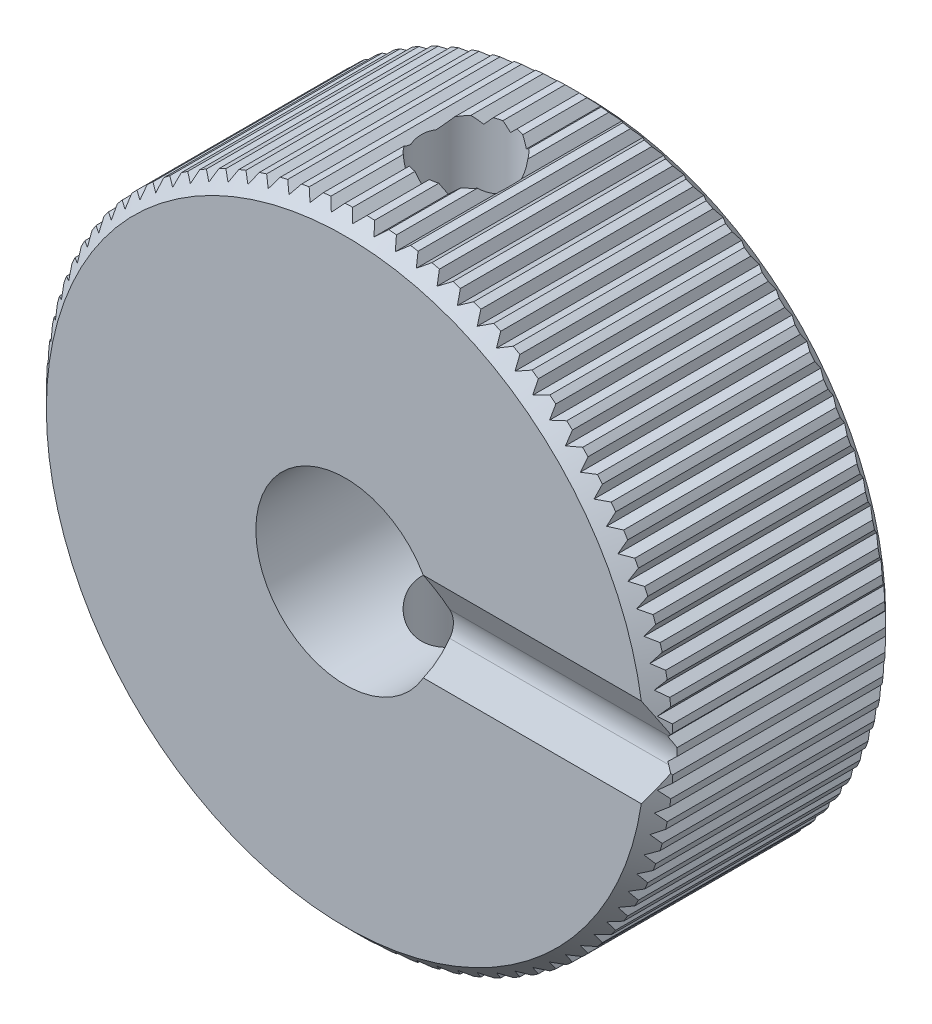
from build123d import *

# Parameters (mm, degrees)
SKETCH1_R               = 5.5499
SKETCH1_R_2             = 1.5875
BOSS_EXTRUDE1_DEPTH     = 2.1336
CHAMFER1_SIZE           = 0.254
CUT_EXTRUDE3_DEPTH      = 9.133574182
CUT_EXTRUDE1_DEPTH      = 9.133574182
CUT_EXTRUDE1_DEPTH_BACK = 9.133574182
SKETCH2_R               = 0.7874
CUT_EXTRUDE2_REACH      = 10.134
CUT_EXTRUDE2_END_RADIUS = 5.5499
CIRPATTERN1_COUNT       = 90


with BuildPart() as part:
    # Sketch1 → Boss-Extrude1 (new, symmetric)
    with BuildSketch(Plane.XY):
        Circle(SKETCH1_R)
        Circle(SKETCH1_R_2, mode=Mode.SUBTRACT)
    extrude(amount=BOSS_EXTRUDE1_DEPTH, both=True)

    # Chamfer1
    chamfer1_edges = [part.edges().sort_by_distance(p)[0] for p in [
        (-5.5499, 0, -2.1336),
        (-5.5499, 0, 2.1336),
    ]]
    chamfer(chamfer1_edges, length=CHAMFER1_SIZE)

    # Sketch4 → Cut-Extrude3 (cut, symmetric)
    with BuildSketch(Plane.XY):
        Polygon((0.127, 5.5499), (-0.127, 5.5499), (0, 5.4229), align=None)
    cut_extrude3 = extrude(amount=CUT_EXTRUDE3_DEPTH, both=True, mode=Mode.SUBTRACT)

    # Sketch2 → Cut-Extrude1 (cut, two sides: drawn at the far end of the back side and taken through both)
    with BuildSketch(Plane(origin=(0, 0, 0), x_dir=(1, 0, 0), z_dir=(0, 1, 0)).offset(-CUT_EXTRUDE1_DEPTH_BACK)):
        with Locations(Location((0, 0, 0), (0, 0, 270))):
            Circle(SKETCH2_R)
    extrude(amount=CUT_EXTRUDE1_DEPTH + CUT_EXTRUDE1_DEPTH_BACK, mode=Mode.SUBTRACT)

    # Cut-Extrude2: up to this cylinder (the profile starts inside it)
    cut_extrude2_end = Plane(origin=(0, 0, 2.013162), z_dir=(0, 0, -1)) * Cylinder(CUT_EXTRUDE2_END_RADIUS, 32.3678, mode=Mode.PRIVATE)
    # Sketch3 → Cut-Extrude2 (cut, up to the surface)
    with BuildSketch(Plane(origin=(0, 0, 0), x_dir=(0, 0, -1), z_dir=(1, 0, 0)), mode=Mode.PRIVATE) as cut_extrude2_sk1:
        with BuildLine():
            Line((-2.1336, 0.7874), (-1.860335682, 0.220621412))
            ThreePointArc((-1.860335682, 0.220621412), (-1.809927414, 0), (-1.860335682, -0.220621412))
            Line((-1.860335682, -0.220621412), (-2.1336, -0.7874))
            Line((-2.1336, -0.7874), (-2.1336, 0.7874))
        make_face()
    cut_extrude2_tool1 = extrude(cut_extrude2_sk1.sketch, amount=CUT_EXTRUDE2_REACH, mode=Mode.PRIVATE) & cut_extrude2_end
    add(cut_extrude2_tool1.solids().sort_by_distance((0, 0, 2.013162))[0], mode=Mode.SUBTRACT)

    # CirPattern1: Cut-Extrude3 ×90 about axis
    cirpattern1_axis = Axis((0, 0, 0), (0, 0, 1))
    for i in range(1, CIRPATTERN1_COUNT):
        add(cut_extrude3.rotate(cirpattern1_axis, i * 360 / CIRPATTERN1_COUNT), mode=Mode.SUBTRACT)


solid = part.part
